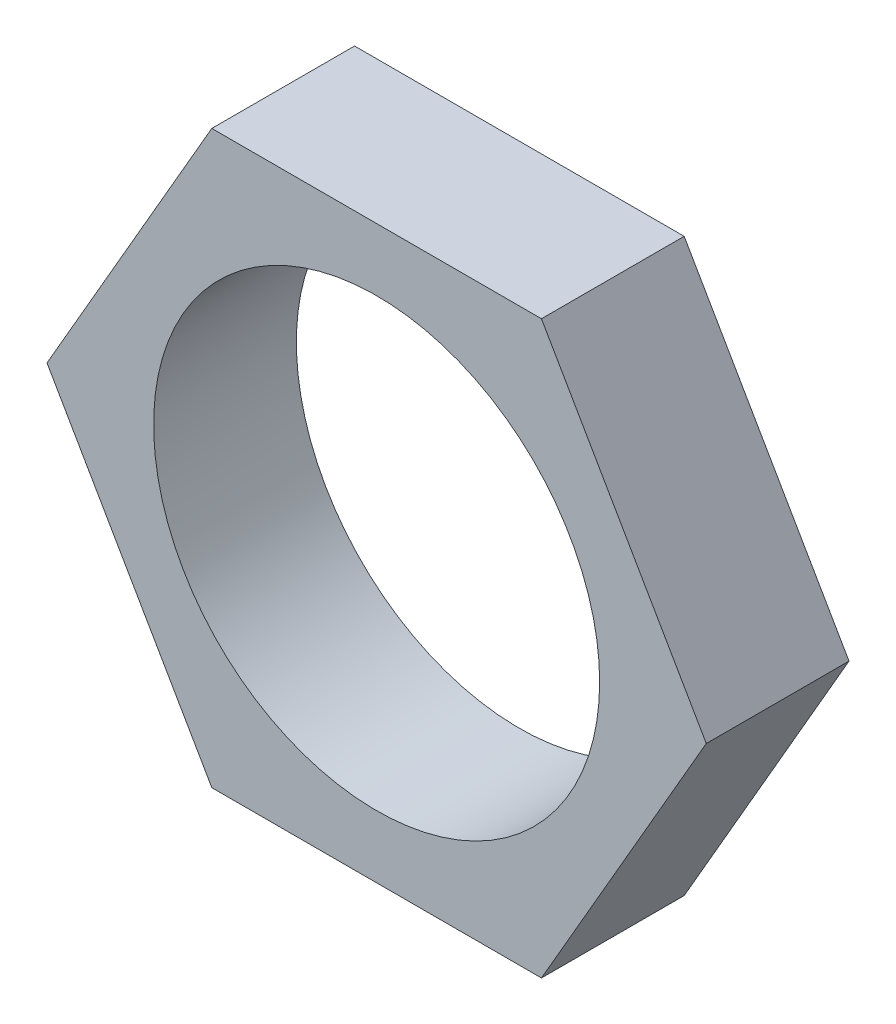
from build123d import *

# Parameters (mm, degrees)
EXTRUSION1_DEPTH       = 8
TROU_TARAUD_M27X2_01_D = 25


with BuildPart() as part:
    # Esquisse1 → Extrusion1 (new body)
    with BuildSketch(Plane.XY):
        Polygon((18.475208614, 0), (9.237604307, 16), (-9.237604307, 16), (-18.475208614, 0), (-9.237604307, -16), (9.237604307, -16), align=None)
    extrude(amount=-EXTRUSION1_DEPTH)

    # Trou taraud_ M27x2.01 (through all)
    with Locations(Plane.XY):
        with Locations((0, 0)):
            Hole(TROU_TARAUD_M27X2_01_D / 2)


solid = part.part
